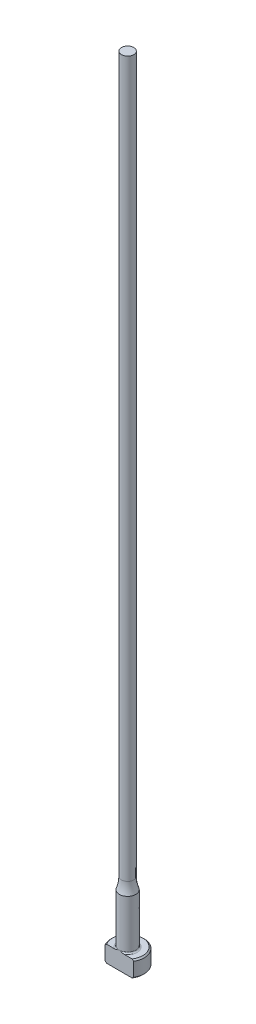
ISO-10303-21;
HEADER;
FILE_DESCRIPTION(('STEP AP214'),'2;1');
FILE_NAME('part.step','',(''),(''),'','','');
FILE_SCHEMA(('AUTOMOTIVE_DESIGN { 1 0 10303 214 1 1 1 1 }'));
ENDSEC;
DATA;
#1=APPLICATION_CONTEXT('core data for automotive mechanical design processes');
#2=APPLICATION_PROTOCOL_DEFINITION('international standard','automotive_design',2000,#1);
#3=PRODUCT_CONTEXT('',#1,'mechanical');
#4=PRODUCT('Part','Part','',(#3));
#5=PRODUCT_RELATED_PRODUCT_CATEGORY('part','',(#4));
#6=PRODUCT_DEFINITION_FORMATION('','',#4);
#7=PRODUCT_DEFINITION_CONTEXT('part definition',#1,'design');
#8=PRODUCT_DEFINITION('design','',#6,#7);
#9=PRODUCT_DEFINITION_SHAPE('','',#8);
#10=(LENGTH_UNIT() NAMED_UNIT(*) SI_UNIT(.MILLI.,.METRE.));
#11=(NAMED_UNIT(*) PLANE_ANGLE_UNIT() SI_UNIT($,.RADIAN.));
#12=(NAMED_UNIT(*) SI_UNIT($,.STERADIAN.) SOLID_ANGLE_UNIT());
#13=UNCERTAINTY_MEASURE_WITH_UNIT(LENGTH_MEASURE(1.E-05),#10,'distance_accuracy_value','');
#14=(GEOMETRIC_REPRESENTATION_CONTEXT(3) GLOBAL_UNCERTAINTY_ASSIGNED_CONTEXT((#13)) GLOBAL_UNIT_ASSIGNED_CONTEXT((#10,
#11,#12)) REPRESENTATION_CONTEXT('',''));
#15=CARTESIAN_POINT('',(0.,0.,0.));
#16=DIRECTION('',(0.,0.,1.));
#17=DIRECTION('',(1.,0.,0.));
#18=AXIS2_PLACEMENT_3D('',#15,#16,#17);
#19=CARTESIAN_POINT('',(-1.18998999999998,152.4,0.));
#20=DIRECTION('',(0.,1.,0.));
#21=DIRECTION('',(0.,0.,1.));
#22=AXIS2_PLACEMENT_3D('',#19,#20,#21);
#23=PLANE('',#22);
#24=CARTESIAN_POINT('',(0.,152.4,0.));
#25=DIRECTION('',(0.,1.,0.));
#26=DIRECTION('',(0.,0.,1.));
#27=AXIS2_PLACEMENT_3D('',#24,#25,#26);
#28=CIRCLE('',#27,1.18998999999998);
#29=CARTESIAN_POINT('',(0.,152.4,1.18998999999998));
#30=VERTEX_POINT('',#29);
#31=EDGE_CURVE('E169',#30,#30,#28,.T.);
#32=ORIENTED_EDGE('',*,*,#31,.T.);
#33=EDGE_LOOP('',(#32));
#34=FACE_BOUND('',#33,.T.);
#35=ADVANCED_FACE('F37',(#34),#23,.T.);
#36=CARTESIAN_POINT('',(0.,259.958771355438,0.));
#37=DIRECTION('',(0.,1.,0.));
#38=DIRECTION('',(0.,0.,1.));
#39=AXIS2_PLACEMENT_3D('',#36,#37,#38);
#40=CYLINDRICAL_SURFACE('',#39,1.18998999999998);
#41=CARTESIAN_POINT('',(0.,14.9114164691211,0.));
#42=DIRECTION('',(0.,1.,0.));
#43=DIRECTION('',(0.,0.,1.));
#44=AXIS2_PLACEMENT_3D('',#41,#42,#43);
#45=CIRCLE('',#44,1.18998999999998);
#46=CARTESIAN_POINT('',(0.,14.9114164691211,1.18998999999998));
#47=VERTEX_POINT('',#46);
#48=EDGE_CURVE('E172',#47,#47,#45,.T.);
#49=ORIENTED_EDGE('',*,*,#48,.T.);
#50=EDGE_LOOP('',(#49));
#51=FACE_BOUND('',#50,.T.);
#52=ORIENTED_EDGE('',*,*,#31,.F.);
#53=EDGE_LOOP('',(#52));
#54=FACE_BOUND('',#53,.T.);
#55=ADVANCED_FACE('F160',(#51,#54),#40,.T.);
#56=CARTESIAN_POINT('',(0.,14.9114164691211,0.));
#57=DIRECTION('',(0.,1.,0.));
#58=DIRECTION('',(0.,0.,1.));
#59=AXIS2_PLACEMENT_3D('',#56,#57,#58);
#60=TOROIDAL_SURFACE('',#59,7.53998999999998,6.35);
#61=CARTESIAN_POINT('',(0.,12.7,0.));
#62=DIRECTION('',(0.,1.,0.));
#63=DIRECTION('',(0.,0.,1.));
#64=AXIS2_PLACEMENT_3D('',#61,#62,#63);
#65=CIRCLE('',#64,1.58749999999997);
#66=CARTESIAN_POINT('',(0.,12.7,1.58749999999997));
#67=VERTEX_POINT('',#66);
#68=EDGE_CURVE('E100',#67,#67,#65,.T.);
#69=ORIENTED_EDGE('',*,*,#68,.T.);
#70=EDGE_LOOP('',(#69));
#71=FACE_BOUND('',#70,.T.);
#72=ORIENTED_EDGE('',*,*,#48,.F.);
#73=EDGE_LOOP('',(#72));
#74=FACE_BOUND('',#73,.T.);
#75=ADVANCED_FACE('F165',(#71,#74),#60,.F.);
#76=CARTESIAN_POINT('',(0.,259.958771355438,0.));
#77=DIRECTION('',(0.,1.,0.));
#78=DIRECTION('',(0.,0.,1.));
#79=AXIS2_PLACEMENT_3D('',#76,#77,#78);
#80=CYLINDRICAL_SURFACE('',#79,1.58749999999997);
#81=CARTESIAN_POINT('',(0.,3.42900000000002,0.));
#82=DIRECTION('',(0.,1.,0.));
#83=DIRECTION('',(0.,0.,1.));
#84=AXIS2_PLACEMENT_3D('',#81,#82,#83);
#85=CIRCLE('',#84,1.58749999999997);
#86=CARTESIAN_POINT('',(0.,3.42900000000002,1.58749999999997));
#87=VERTEX_POINT('',#86);
#88=EDGE_CURVE('E109',#87,#87,#85,.T.);
#89=ORIENTED_EDGE('',*,*,#88,.T.);
#90=EDGE_LOOP('',(#89));
#91=FACE_BOUND('',#90,.T.);
#92=ORIENTED_EDGE('',*,*,#68,.F.);
#93=EDGE_LOOP('',(#92));
#94=FACE_BOUND('',#93,.T.);
#95=ADVANCED_FACE('F192',(#91,#94),#80,.T.);
#96=CARTESIAN_POINT('',(-3.17499999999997,3.175,0.));
#97=DIRECTION('',(0.,1.,0.));
#98=DIRECTION('',(0.,0.,1.));
#99=AXIS2_PLACEMENT_3D('',#96,#97,#98);
#100=PLANE('',#99);
#101=DIRECTION('',(-1.,0.,0.));
#102=VECTOR('',#101,1.);
#103=CARTESIAN_POINT('',(-3.17499999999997,3.175,1.58749999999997));
#104=LINE('',#103,#102);
#105=CARTESIAN_POINT('',(2.45195529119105,3.175,1.58749999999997));
#106=VERTEX_POINT('',#105);
#107=CARTESIAN_POINT('',(0.933255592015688,3.175,1.58749999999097));
#108=VERTEX_POINT('',#107);
#109=EDGE_CURVE('E58',#106,#108,#104,.T.);
#110=ORIENTED_EDGE('',*,*,#109,.F.);
#111=CARTESIAN_POINT('',(0.,3.175,0.));
#112=DIRECTION('',(0.,1.,0.));
#113=DIRECTION('',(0.,0.,1.));
#114=AXIS2_PLACEMENT_3D('',#111,#112,#113);
#115=CIRCLE('',#114,2.92099999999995);
#116=CARTESIAN_POINT('',(-2.45195529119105,3.175,1.58749999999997));
#117=VERTEX_POINT('',#116);
#118=EDGE_CURVE('E171',#106,#117,#115,.T.);
#119=ORIENTED_EDGE('',*,*,#118,.T.);
#120=CARTESIAN_POINT('',(-0.933255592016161,3.17500000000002,1.58749999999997));
#121=VERTEX_POINT('',#120);
#122=EDGE_CURVE('E140',#121,#117,#104,.T.);
#123=ORIENTED_EDGE('',*,*,#122,.F.);
#124=CARTESIAN_POINT('',(0.,3.175,0.));
#125=DIRECTION('',(0.,1.,0.));
#126=DIRECTION('',(0.,0.,1.));
#127=AXIS2_PLACEMENT_3D('',#124,#125,#126);
#128=CIRCLE('',#127,1.84149999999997);
#129=EDGE_CURVE('E113',#121,#108,#128,.F.);
#130=ORIENTED_EDGE('',*,*,#129,.T.);
#131=EDGE_LOOP('',(#110,#119,#123,#130));
#132=FACE_BOUND('',#131,.T.);
#133=ADVANCED_FACE('F189',(#132),#100,.T.);
#134=CARTESIAN_POINT('',(0.,259.958771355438,0.));
#135=DIRECTION('',(0.,1.,0.));
#136=DIRECTION('',(0.,0.,1.));
#137=AXIS2_PLACEMENT_3D('',#134,#135,#136);
#138=CYLINDRICAL_SURFACE('',#137,3.17499999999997);
#139=DIRECTION('',(0.,-1.,0.));
#140=VECTOR('',#139,1.);
#141=CARTESIAN_POINT('',(-2.74963065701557,152.4,1.58749999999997));
#142=LINE('',#141,#140);
#143=CARTESIAN_POINT('',(-2.74963065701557,2.921,1.58749999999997));
#144=VERTEX_POINT('',#143);
#145=CARTESIAN_POINT('',(-2.74963065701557,0.254000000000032,1.58749999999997));
#146=VERTEX_POINT('',#145);
#147=EDGE_CURVE('E95',#144,#146,#142,.T.);
#148=ORIENTED_EDGE('',*,*,#147,.F.);
#149=CARTESIAN_POINT('',(0.,2.92100000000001,0.));
#150=DIRECTION('',(0.,1.,0.));
#151=DIRECTION('',(0.,0.,1.));
#152=AXIS2_PLACEMENT_3D('',#149,#150,#151);
#153=CIRCLE('',#152,3.17499999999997);
#154=CARTESIAN_POINT('',(2.74963065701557,2.921,1.58749999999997));
#155=VERTEX_POINT('',#154);
#156=EDGE_CURVE('E110',#144,#155,#153,.F.);
#157=ORIENTED_EDGE('',*,*,#156,.T.);
#158=DIRECTION('',(0.,-1.,0.));
#159=VECTOR('',#158,1.);
#160=CARTESIAN_POINT('',(2.74963065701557,152.4,1.58749999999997));
#161=LINE('',#160,#159);
#162=CARTESIAN_POINT('',(2.74963065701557,0.254000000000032,1.58749999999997));
#163=VERTEX_POINT('',#162);
#164=EDGE_CURVE('E182',#155,#163,#161,.T.);
#165=ORIENTED_EDGE('',*,*,#164,.T.);
#166=CARTESIAN_POINT('',(0.,0.254000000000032,0.));
#167=DIRECTION('',(0.,-1.,0.));
#168=DIRECTION('',(0.,0.,-1.));
#169=AXIS2_PLACEMENT_3D('',#166,#167,#168);
#170=CIRCLE('',#169,3.17499999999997);
#171=EDGE_CURVE('E116',#163,#146,#170,.F.);
#172=ORIENTED_EDGE('',*,*,#171,.T.);
#173=EDGE_LOOP('',(#148,#157,#165,#172));
#174=FACE_BOUND('',#173,.T.);
#175=ADVANCED_FACE('F180',(#174),#138,.T.);
#176=CARTESIAN_POINT('',(0.,0.,0.));
#177=DIRECTION('',(0.,-1.,0.));
#178=DIRECTION('',(0.,0.,-1.));
#179=AXIS2_PLACEMENT_3D('',#176,#177,#178);
#180=PLANE('',#179);
#181=DIRECTION('',(1.,0.,0.));
#182=VECTOR('',#181,1.);
#183=CARTESIAN_POINT('',(-2.74963065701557,0.,1.58749999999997));
#184=LINE('',#183,#182);
#185=CARTESIAN_POINT('',(-2.45195529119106,0.,1.58749999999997));
#186=VERTEX_POINT('',#185);
#187=CARTESIAN_POINT('',(2.45195529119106,0.,1.58749999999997));
#188=VERTEX_POINT('',#187);
#189=EDGE_CURVE('E92',#186,#188,#184,.T.);
#190=ORIENTED_EDGE('',*,*,#189,.F.);
#191=CARTESIAN_POINT('',(0.,0.,0.));
#192=DIRECTION('',(0.,-1.,0.));
#193=DIRECTION('',(0.,0.,-1.));
#194=AXIS2_PLACEMENT_3D('',#191,#192,#193);
#195=CIRCLE('',#194,2.92099999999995);
#196=EDGE_CURVE('E106',#186,#188,#195,.T.);
#197=ORIENTED_EDGE('',*,*,#196,.T.);
#198=EDGE_LOOP('',(#190,#197));
#199=FACE_BOUND('',#198,.T.);
#200=ADVANCED_FACE('F105',(#199),#180,.T.);
#201=CARTESIAN_POINT('',(0.,3.17499999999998,0.));
#202=DIRECTION('',(0.,-1.,0.));
#203=DIRECTION('',(0.,0.,-1.));
#204=AXIS2_PLACEMENT_3D('',#201,#202,#203);
#205=CONICAL_SURFACE('',#204,2.92099999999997,0.7853981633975);
#206=CARTESIAN_POINT('',(2.75033065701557,2.9203937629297,1.58749999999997));
#207=CARTESIAN_POINT('',(2.66887796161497,2.99091042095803,1.58749999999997));
#208=CARTESIAN_POINT('',(2.58705989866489,3.0610138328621,1.58749999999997));
#209=CARTESIAN_POINT('',(2.42241022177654,3.20009957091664,1.58749999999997));
#210=CARTESIAN_POINT('',(2.33957813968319,3.26908134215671,1.58749999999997));
#211=CARTESIAN_POINT('',(2.17073968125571,3.40716024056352,1.58749999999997));
#212=CARTESIAN_POINT('',(2.08470440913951,3.47622217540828,1.58749999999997));
#213=CARTESIAN_POINT('',(1.91099881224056,3.61222325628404,1.58749999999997));
#214=CARTESIAN_POINT('',(1.82332890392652,3.67916293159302,1.58749999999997));
#215=CARTESIAN_POINT('',(1.64569223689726,3.81020667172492,1.58749999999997));
#216=CARTESIAN_POINT('',(1.55572245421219,3.87430666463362,1.58749999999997));
#217=CARTESIAN_POINT('',(1.37280394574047,3.99833089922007,1.58749999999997));
#218=CARTESIAN_POINT('',(1.27985285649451,4.05825170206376,1.58749999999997));
#219=CARTESIAN_POINT('',(1.09086561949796,4.17130826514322,1.58749999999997));
#220=CARTESIAN_POINT('',(0.99485990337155,4.22449421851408,1.58749999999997));
#221=CARTESIAN_POINT('',(0.798114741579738,4.32122233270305,1.58749999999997));
#222=CARTESIAN_POINT('',(0.697384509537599,4.36478238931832,1.58749999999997));
#223=CARTESIAN_POINT('',(0.541185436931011,4.4195165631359,1.58749999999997));
#224=CARTESIAN_POINT('',(0.487627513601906,4.43611950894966,1.58749999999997));
#225=CARTESIAN_POINT('',(0.379267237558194,4.46466012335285,1.58749999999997));
#226=CARTESIAN_POINT('',(0.324465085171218,4.47659853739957,1.58749999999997));
#227=CARTESIAN_POINT('',(0.214272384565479,4.49501904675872,1.58749999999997));
#228=CARTESIAN_POINT('',(0.158887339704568,4.50153345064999,1.58749999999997));
#229=CARTESIAN_POINT('',(0.0477364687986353,4.50875028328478,1.58749999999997));
#230=CARTESIAN_POINT('',(-0.00802931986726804,4.50945327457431,1.58749999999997));
#231=CARTESIAN_POINT('',(-0.119372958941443,4.50499163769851,1.58749999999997));
#232=CARTESIAN_POINT('',(-0.174950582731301,4.49982147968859,1.58749999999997));
#233=CARTESIAN_POINT('',(-0.285312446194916,4.48399101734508,1.58749999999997));
#234=CARTESIAN_POINT('',(-0.340096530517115,4.47332965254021,1.58749999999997));
#235=CARTESIAN_POINT('',(-0.448865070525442,4.44711334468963,1.58749999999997));
#236=CARTESIAN_POINT('',(-0.50284128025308,4.43152477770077,1.58749999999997));
#237=CARTESIAN_POINT('',(-0.609429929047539,4.39628553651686,1.58749999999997));
#238=CARTESIAN_POINT('',(-0.66204236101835,4.3766348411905,1.58749999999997));
#239=CARTESIAN_POINT('',(-0.778129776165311,4.32902110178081,1.58749999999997));
#240=CARTESIAN_POINT('',(-0.84124591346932,4.30019026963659,1.58749999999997));
#241=CARTESIAN_POINT('',(-0.965594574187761,4.23868811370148,1.58749999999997));
#242=CARTESIAN_POINT('',(-1.02682597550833,4.20601455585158,1.58749999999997));
#243=CARTESIAN_POINT('',(-1.14774341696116,4.13769010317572,1.58749999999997));
#244=CARTESIAN_POINT('',(-1.20742632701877,4.10203371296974,1.58749999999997));
#245=CARTESIAN_POINT('',(-1.32539130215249,4.02846531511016,1.58749999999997));
#246=CARTESIAN_POINT('',(-1.38367308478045,3.9905528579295,1.58749999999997));
#247=CARTESIAN_POINT('',(-1.55734442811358,3.87382704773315,1.58749999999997));
#248=CARTESIAN_POINT('',(-1.67095842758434,3.79237897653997,1.58749999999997));
#249=CARTESIAN_POINT('',(-1.8947523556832,3.6252186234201,1.58749999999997));
#250=CARTESIAN_POINT('',(-2.00493591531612,3.53951111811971,1.58749999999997));
#251=CARTESIAN_POINT('',(-2.22248693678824,3.3655494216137,1.58749999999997));
#252=CARTESIAN_POINT('',(-2.32986450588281,3.27730782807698,1.58749999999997));
#253=CARTESIAN_POINT('',(-2.48909538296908,3.14389342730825,1.58749999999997));
#254=CARTESIAN_POINT('',(-2.54159338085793,3.09948435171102,1.58749999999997));
#255=CARTESIAN_POINT('',(-2.64622282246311,3.01024124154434,1.58749999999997));
#256=CARTESIAN_POINT('',(-2.69835428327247,2.96540722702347,1.58749999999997));
#257=CARTESIAN_POINT('',(-2.75033065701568,2.92039376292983,1.58749999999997));
#258=B_SPLINE_CURVE_WITH_KNOTS('',3,(#206,#207,#208,#209,#210,#211,#212,#213,#214,#215,#216,
#217,#218,#219,#220,#221,#222,#223,#224,#225,#226,#227,#228,#229,#230,#231,#232,#233,#234,#235,
#236,#237,#238,#239,#240,#241,#242,#243,#244,#245,#246,#247,#248,#249,#250,#251,#252,#253,#254,
#255,#256,#257),.UNSPECIFIED.,.F.,.F.,(4,2,2,2,2,2,2,2,2,2,2,2,2,2,2,2,2,2,2,2,2,2,2,2,2,4),(0.,
0.323216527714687,0.64658837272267,0.977539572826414,1.30840757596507,1.63973560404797,
1.97133312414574,2.30029221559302,2.62863448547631,2.79668277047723,2.9647041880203,
3.13171746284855,3.29871457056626,3.46586904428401,3.63305581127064,3.80140905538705,
3.96976317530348,4.17775353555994,4.38586541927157,4.59436953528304,4.80291533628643,
5.22209642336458,5.64081759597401,6.0577303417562,6.26401477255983,6.47028951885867),.UNSPECIFIED.);
#259=EDGE_CURVE('E63',#155,#106,#258,.T.);
#260=ORIENTED_EDGE('',*,*,#259,.F.);
#261=ORIENTED_EDGE('',*,*,#156,.F.);
#262=EDGE_CURVE('E133',#117,#144,#258,.T.);
#263=ORIENTED_EDGE('',*,*,#262,.F.);
#264=ORIENTED_EDGE('',*,*,#118,.F.);
#265=EDGE_LOOP('',(#260,#261,#263,#264));
#266=FACE_BOUND('',#265,.T.);
#267=ADVANCED_FACE('F147',(#266),#205,.T.);
#268=CARTESIAN_POINT('',(0.,0.254000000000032,0.));
#269=DIRECTION('',(0.,1.,0.));
#270=DIRECTION('',(0.,0.,1.));
#271=AXIS2_PLACEMENT_3D('',#268,#269,#270);
#272=CONICAL_SURFACE('',#271,3.17499999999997,0.785398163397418);
#273=CARTESIAN_POINT('',(-2.75033065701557,0.254606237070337,1.58749999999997));
#274=CARTESIAN_POINT('',(-2.66887796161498,0.184089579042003,1.58749999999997));
#275=CARTESIAN_POINT('',(-2.58705989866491,0.113986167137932,1.58749999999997));
#276=CARTESIAN_POINT('',(-2.42241022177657,-0.0250995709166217,1.58749999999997));
#277=CARTESIAN_POINT('',(-2.33957813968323,-0.0940813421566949,1.58749999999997));
#278=CARTESIAN_POINT('',(-2.17073968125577,-0.232160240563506,1.58749999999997));
#279=CARTESIAN_POINT('',(-2.08470440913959,-0.301222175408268,1.58749999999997));
#280=CARTESIAN_POINT('',(-1.91099881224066,-0.437223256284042,1.58749999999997));
#281=CARTESIAN_POINT('',(-1.82332890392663,-0.504162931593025,1.58749999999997));
#282=CARTESIAN_POINT('',(-1.64569223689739,-0.635206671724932,1.58749999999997));
#283=CARTESIAN_POINT('',(-1.55572245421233,-0.699306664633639,1.58749999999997));
#284=CARTESIAN_POINT('',(-1.37280394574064,-0.8233308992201,1.58749999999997));
#285=CARTESIAN_POINT('',(-1.27985285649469,-0.883251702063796,1.58749999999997));
#286=CARTESIAN_POINT('',(-1.09086561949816,-0.996308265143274,1.58749999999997));
#287=CARTESIAN_POINT('',(-0.994859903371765,-1.04949421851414,1.58749999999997));
#288=CARTESIAN_POINT('',(-0.798114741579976,-1.14622233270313,1.58749999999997));
#289=CARTESIAN_POINT('',(-0.697384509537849,-1.18978238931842,1.58749999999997));
#290=CARTESIAN_POINT('',(-0.54118543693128,-1.24451656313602,1.58749999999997));
#291=CARTESIAN_POINT('',(-0.487627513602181,-1.26111950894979,1.58749999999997));
#292=CARTESIAN_POINT('',(-0.379267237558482,-1.28966012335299,1.58749999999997));
#293=CARTESIAN_POINT('',(-0.324465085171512,-1.30159853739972,1.58749999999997));
#294=CARTESIAN_POINT('',(-0.214272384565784,-1.3200190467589,1.58749999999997));
#295=CARTESIAN_POINT('',(-0.158887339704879,-1.32653345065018,1.58749999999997));
#296=CARTESIAN_POINT('',(-0.0477364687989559,-1.33375028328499,1.58749999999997));
#297=CARTESIAN_POINT('',(0.00802931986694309,-1.33445327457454,1.58749999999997));
#298=CARTESIAN_POINT('',(0.119372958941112,-1.32999163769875,1.58749999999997));
#299=CARTESIAN_POINT('',(0.174950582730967,-1.32482147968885,1.58749999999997));
#300=CARTESIAN_POINT('',(0.28531244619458,-1.30899101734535,1.58749999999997));
#301=CARTESIAN_POINT('',(0.340096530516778,-1.2983296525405,1.58749999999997));
#302=CARTESIAN_POINT('',(0.448865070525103,-1.27211334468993,1.58749999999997));
#303=CARTESIAN_POINT('',(0.50284128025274,-1.25652477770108,1.58749999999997));
#304=CARTESIAN_POINT('',(0.609429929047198,-1.22128553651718,1.58749999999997));
#305=CARTESIAN_POINT('',(0.662042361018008,-1.20163484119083,1.58749999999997));
#306=CARTESIAN_POINT('',(0.778129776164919,-1.15402110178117,1.58749999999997));
#307=CARTESIAN_POINT('',(0.84124591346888,-1.12519026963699,1.58749999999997));
#308=CARTESIAN_POINT('',(0.965594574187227,-1.06368811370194,1.58749999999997));
#309=CARTESIAN_POINT('',(1.02682597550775,-1.03101455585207,1.58749999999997));
#310=CARTESIAN_POINT('',(1.14774341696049,-0.962690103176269,1.58749999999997));
#311=CARTESIAN_POINT('',(1.20742632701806,-0.927033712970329,1.58749999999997));
#312=CARTESIAN_POINT('',(1.32539130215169,-0.853465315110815,1.58749999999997));
#313=CARTESIAN_POINT('',(1.38367308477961,-0.815552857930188,1.58749999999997));
#314=CARTESIAN_POINT('',(1.5573444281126,-0.698827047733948,1.58749999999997));
#315=CARTESIAN_POINT('',(1.67095842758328,-0.617378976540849,1.58749999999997));
#316=CARTESIAN_POINT('',(1.89475235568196,-0.450218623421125,1.58749999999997));
#317=CARTESIAN_POINT('',(2.0049359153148,-0.364511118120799,1.58749999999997));
#318=CARTESIAN_POINT('',(2.22248693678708,-0.190549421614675,1.58749999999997));
#319=CARTESIAN_POINT('',(2.32986450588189,-0.102307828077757,1.58749999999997));
#320=CARTESIAN_POINT('',(2.48909538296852,0.0311065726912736,1.58749999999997));
#321=CARTESIAN_POINT('',(2.54159338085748,0.0755156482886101,1.58749999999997));
#322=CARTESIAN_POINT('',(2.64622282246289,0.164758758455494,1.58749999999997));
#323=CARTESIAN_POINT('',(2.69835428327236,0.20959277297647,1.58749999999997));
#324=CARTESIAN_POINT('',(2.75033065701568,0.25460623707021,1.58749999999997));
#325=B_SPLINE_CURVE_WITH_KNOTS('',3,(#273,#274,#275,#276,#277,#278,#279,#280,#281,#282,#283,
#284,#285,#286,#287,#288,#289,#290,#291,#292,#293,#294,#295,#296,#297,#298,#299,#300,#301,#302,
#303,#304,#305,#306,#307,#308,#309,#310,#311,#312,#313,#314,#315,#316,#317,#318,#319,#320,#321,
#322,#323,#324),.UNSPECIFIED.,.F.,.F.,(4,2,2,2,2,2,2,2,2,2,2,2,2,2,2,2,2,2,2,2,2,2,2,2,2,4),(0.,
0.323216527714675,0.646588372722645,0.977539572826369,1.308407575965,1.63973560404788,
1.97133312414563,2.3002922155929,2.62863448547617,2.79668277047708,2.96470418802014,
3.13171746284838,3.29871457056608,3.46586904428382,3.63305581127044,3.80140905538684,
3.96976317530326,4.17775353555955,4.38586541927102,4.59436953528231,4.80291533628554,
5.22209642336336,5.64081759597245,6.05773034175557,6.26401477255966,6.47028951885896),.UNSPECIFIED.);
#326=EDGE_CURVE('E89',#146,#186,#325,.T.);
#327=ORIENTED_EDGE('',*,*,#326,.F.);
#328=ORIENTED_EDGE('',*,*,#171,.F.);
#329=EDGE_CURVE('E101',#188,#163,#325,.T.);
#330=ORIENTED_EDGE('',*,*,#329,.F.);
#331=ORIENTED_EDGE('',*,*,#196,.F.);
#332=EDGE_LOOP('',(#327,#328,#330,#331));
#333=FACE_BOUND('',#332,.T.);
#334=ADVANCED_FACE('F108',(#333),#272,.T.);
#335=CARTESIAN_POINT('',(0.,3.42900000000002,0.));
#336=DIRECTION('',(0.,1.,0.));
#337=DIRECTION('',(0.,0.,1.));
#338=AXIS2_PLACEMENT_3D('',#335,#336,#337);
#339=TOROIDAL_SURFACE('',#338,1.84149999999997,0.254);
#340=ORIENTED_EDGE('',*,*,#129,.F.);
#341=CARTESIAN_POINT('',(0.,3.42900000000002,1.58749999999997));
#342=CARTESIAN_POINT('',(-1.9220500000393E-10,3.42900057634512,1.58749999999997));
#343=CARTESIAN_POINT('',(-1.22611614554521E-07,3.42900115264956,1.58749999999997));
#344=CARTESIAN_POINT('',(-5.09676364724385E-07,3.42900226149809,1.58749999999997));
#345=CARTESIAN_POINT('',(-7.78176327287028E-07,3.42900279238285,1.58749999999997));
#346=CARTESIAN_POINT('',(-1.42307272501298E-06,3.42900385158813,1.58749999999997));
#347=CARTESIAN_POINT('',(-1.80713867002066E-06,3.42900437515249,1.58749999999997));
#348=CARTESIAN_POINT('',(-2.63494846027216E-06,3.42900536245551,1.58749999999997));
#349=CARTESIAN_POINT('',(-3.07814756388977E-06,3.42900582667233,1.58749999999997));
#350=CARTESIAN_POINT('',(-4.66897357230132E-06,3.42900738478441,1.58749999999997));
#351=CARTESIAN_POINT('',(-5.89404907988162E-06,3.42900840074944,1.58749999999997));
#352=CARTESIAN_POINT('',(-8.42427510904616E-06,3.42901020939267,1.58749999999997));
#353=CARTESIAN_POINT('',(-9.72480574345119E-06,3.42901100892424,1.58749999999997));
#354=CARTESIAN_POINT('',(-1.48060601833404E-05,3.42901401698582,1.58749999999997));
#355=CARTESIAN_POINT('',(-1.86838281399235E-05,3.42901606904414,1.58749999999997));
#356=CARTESIAN_POINT('',(-2.63261117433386E-05,3.42901942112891,1.58749999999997));
#357=CARTESIAN_POINT('',(-3.0068741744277E-05,3.42902077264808,1.58749999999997));
#358=CARTESIAN_POINT('',(-4.60276298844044E-05,3.42902652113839,1.58749999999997));
#359=CARTESIAN_POINT('',(-5.82470198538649E-05,3.42903088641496,1.58749999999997));
#360=CARTESIAN_POINT('',(-8.11070097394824E-05,3.42903788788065,1.58749999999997));
#361=CARTESIAN_POINT('',(-9.16953114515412E-05,3.42904068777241,1.58749999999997));
#362=CARTESIAN_POINT('',(-0.000168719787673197,3.42906287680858,1.58749999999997));
#363=CARTESIAN_POINT('',(-0.000232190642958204,3.4290911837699,1.58749999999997));
#364=CARTESIAN_POINT('',(-0.000479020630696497,3.42919723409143,1.58749999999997));
#365=CARTESIAN_POINT('',(-0.000664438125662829,3.42926834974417,1.58749999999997));
#366=CARTESIAN_POINT('',(-0.0013844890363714,3.42954862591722,1.58749999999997));
#367=CARTESIAN_POINT('',(-0.00191701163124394,3.42976473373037,1.58749999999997));
#368=CARTESIAN_POINT('',(-0.00409774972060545,3.4306455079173,1.58749999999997));
#369=CARTESIAN_POINT('',(-0.00574830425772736,3.43130231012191,1.58749999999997));
#370=CARTESIAN_POINT('',(-0.0289985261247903,3.4405594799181,1.58749999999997));
#371=CARTESIAN_POINT('',(-0.0505816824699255,3.4492167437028,1.58749999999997));
#372=CARTESIAN_POINT('',(-0.0929947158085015,3.46610702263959,1.58749999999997));
#373=CARTESIAN_POINT('',(-0.113823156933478,3.47434394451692,1.58749999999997));
#374=CARTESIAN_POINT('',(-0.157956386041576,3.49164606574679,1.58749999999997));
#375=CARTESIAN_POINT('',(-0.181267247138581,3.50069608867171,1.58749999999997));
#376=CARTESIAN_POINT('',(-0.228222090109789,3.51863224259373,1.58749999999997));
#377=CARTESIAN_POINT('',(-0.25186705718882,3.52751579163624,1.58749999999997));
#378=CARTESIAN_POINT('',(-0.310512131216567,3.54905503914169,1.58749999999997));
#379=CARTESIAN_POINT('',(-0.345588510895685,3.56150550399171,1.58749999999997));
#380=CARTESIAN_POINT('',(-0.415278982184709,3.5850302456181,1.58749999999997));
#381=CARTESIAN_POINT('',(-0.449884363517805,3.59613012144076,1.58749999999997));
#382=CARTESIAN_POINT('',(-0.524471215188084,3.61841679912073,1.58749999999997));
#383=CARTESIAN_POINT('',(-0.564517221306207,3.62939137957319,1.58749999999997));
#384=CARTESIAN_POINT('',(-0.645529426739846,3.6489746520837,1.58749999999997));
#385=CARTESIAN_POINT('',(-0.686500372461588,3.65756417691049,1.58749999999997));
#386=CARTESIAN_POINT('',(-0.771546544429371,3.67188287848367,1.58749999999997));
#387=CARTESIAN_POINT('',(-0.815658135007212,3.67740449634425,1.58749999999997));
#388=CARTESIAN_POINT('',(-0.904117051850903,3.68344603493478,1.58749999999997));
#389=CARTESIAN_POINT('',(-0.948462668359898,3.68398638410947,1.58749999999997));
#390=CARTESIAN_POINT('',(-1.02531896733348,3.67901051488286,1.58749999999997));
#391=CARTESIAN_POINT('',(-1.05792141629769,3.67502604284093,1.58749999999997));
#392=CARTESIAN_POINT('',(-1.12184393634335,3.66230832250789,1.58749999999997));
#393=CARTESIAN_POINT('',(-1.1531753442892,3.65363950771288,1.58749999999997));
#394=CARTESIAN_POINT('',(-1.19946468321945,3.6356384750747,1.58749999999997));
#395=CARTESIAN_POINT('',(-1.21526783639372,3.62848492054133,1.58749999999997));
#396=CARTESIAN_POINT('',(-1.24583726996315,3.61212937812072,1.58749999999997));
#397=CARTESIAN_POINT('',(-1.26060215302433,3.60292469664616,1.58749999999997));
#398=CARTESIAN_POINT('',(-1.28575815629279,3.58421518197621,1.58749999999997));
#399=CARTESIAN_POINT('',(-1.29644383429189,3.57510998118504,1.58749999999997));
#400=CARTESIAN_POINT('',(-1.31623154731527,3.55531539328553,1.58749999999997));
#401=CARTESIAN_POINT('',(-1.32533681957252,3.54462932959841,1.58749999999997));
#402=CARTESIAN_POINT('',(-1.33941140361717,3.52450022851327,1.58749999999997));
#403=CARTESIAN_POINT('',(-1.34484814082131,3.51538553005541,1.58749999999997));
#404=CARTESIAN_POINT('',(-1.35416329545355,3.49638544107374,1.58749999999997));
#405=CARTESIAN_POINT('',(-1.35804267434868,3.48650053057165,1.58749999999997));
#406=CARTESIAN_POINT('',(-1.36398436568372,3.46611321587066,1.58749999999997));
#407=CARTESIAN_POINT('',(-1.36603350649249,3.45560690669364,1.58749999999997));
#408=CARTESIAN_POINT('',(-1.3680840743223,3.43439627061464,1.58749999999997));
#409=CARTESIAN_POINT('',(-1.36808648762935,3.42369204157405,1.58749999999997));
#410=CARTESIAN_POINT('',(-1.36616208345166,3.40366716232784,1.58749999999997));
#411=CARTESIAN_POINT('',(-1.36444960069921,3.39432493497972,1.58749999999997));
#412=CARTESIAN_POINT('',(-1.35953338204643,3.37604480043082,1.58749999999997));
#413=CARTESIAN_POINT('',(-1.3563294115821,3.36710695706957,1.58749999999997));
#414=CARTESIAN_POINT('',(-1.34848006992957,3.34949697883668,1.58749999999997));
#415=CARTESIAN_POINT('',(-1.34378578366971,3.34084688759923,1.58749999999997));
#416=CARTESIAN_POINT('',(-1.33324445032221,3.32428742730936,1.58749999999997));
#417=CARTESIAN_POINT('',(-1.32739692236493,3.31637836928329,1.58749999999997));
#418=CARTESIAN_POINT('',(-1.31107304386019,3.29692878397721,1.58749999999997));
#419=CARTESIAN_POINT('',(-1.29989286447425,3.28597778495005,1.58749999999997));
#420=CARTESIAN_POINT('',(-1.27593566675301,3.26597490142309,1.58749999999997));
#421=CARTESIAN_POINT('',(-1.2631537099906,3.25692913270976,1.58749999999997));
#422=CARTESIAN_POINT('',(-1.22930733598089,3.23613976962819,1.58749999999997));
#423=CARTESIAN_POINT('',(-1.20751096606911,3.22559415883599,1.58749999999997));
#424=CARTESIAN_POINT('',(-1.16266144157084,3.20795356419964,1.58749999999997));
#425=CARTESIAN_POINT('',(-1.13960937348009,3.20085564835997,1.58749999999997));
#426=CARTESIAN_POINT('',(-1.07603916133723,3.18534571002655,1.58749999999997));
#427=CARTESIAN_POINT('',(-1.03486686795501,3.17965078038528,1.58749999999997));
#428=CARTESIAN_POINT('',(-0.951558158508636,3.1741711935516,1.58749999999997));
#429=CARTESIAN_POINT('',(-0.909417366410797,3.17449023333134,1.58749999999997));
#430=CARTESIAN_POINT('',(-0.811383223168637,3.18054602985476,1.58749999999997));
#431=CARTESIAN_POINT('',(-0.755610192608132,3.18806126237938,1.58749999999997));
#432=CARTESIAN_POINT('',(-0.644937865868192,3.20866626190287,1.58749999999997));
#433=CARTESIAN_POINT('',(-0.590043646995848,3.2217810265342,1.58749999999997));
#434=CARTESIAN_POINT('',(-0.485757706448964,3.25059077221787,1.58749999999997));
#435=CARTESIAN_POINT('',(-0.436281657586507,3.2659890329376,1.58749999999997));
#436=CARTESIAN_POINT('',(-0.338551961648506,3.29877502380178,1.58749999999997));
#437=CARTESIAN_POINT('',(-0.290291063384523,3.31614156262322,1.58749999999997));
#438=CARTESIAN_POINT('',(-0.225557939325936,3.34039762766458,1.58749999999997));
#439=CARTESIAN_POINT('',(-0.208874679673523,3.34673586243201,1.58749999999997));
#440=CARTESIAN_POINT('',(-0.175123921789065,3.35969957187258,1.58749999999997));
#441=CARTESIAN_POINT('',(-0.158057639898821,3.36632823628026,1.58749999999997));
#442=CARTESIAN_POINT('',(-0.117638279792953,3.38214476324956,1.58749999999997));
#443=CARTESIAN_POINT('',(-0.0943002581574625,3.39137029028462,1.58749999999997));
#444=CARTESIAN_POINT('',(-0.049782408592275,3.40910304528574,1.58749999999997));
#445=CARTESIAN_POINT('',(-0.028598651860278,3.41759960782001,1.58749999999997));
#446=CARTESIAN_POINT('',(-0.00575168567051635,3.42669635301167,1.58749999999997));
#447=CARTESIAN_POINT('',(-0.00410451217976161,3.42735181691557,1.58749999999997));
#448=CARTESIAN_POINT('',(-0.00192459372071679,3.42823223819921,1.58749999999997));
#449=CARTESIAN_POINT('',(-0.00138952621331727,3.42844937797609,1.58749999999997));
#450=CARTESIAN_POINT('',(-0.000666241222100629,3.42873091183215,1.58749999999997));
#451=CARTESIAN_POINT('',(-0.000480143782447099,3.42880228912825,1.58749999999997));
#452=CARTESIAN_POINT('',(-0.000232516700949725,3.4289086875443,1.58749999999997));
#453=CARTESIAN_POINT('',(-0.00016892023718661,3.42893705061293,1.58749999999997));
#454=CARTESIAN_POINT('',(-9.17527161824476E-05,3.42895927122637,1.58749999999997));
#455=CARTESIAN_POINT('',(-8.11550293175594E-05,3.42896207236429,1.58749999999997));
#456=CARTESIAN_POINT('',(-5.82743948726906E-05,3.4289690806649,1.58749999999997));
#457=CARTESIAN_POINT('',(-4.60440001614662E-05,3.4289734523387,1.58749999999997));
#458=CARTESIAN_POINT('',(-3.00727682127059E-05,3.42897920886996,1.58749999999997));
#459=CARTESIAN_POINT('',(-2.63286807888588E-05,3.42898056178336,1.58749999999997));
#460=CARTESIAN_POINT('',(-1.86836529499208E-05,3.42898391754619,1.58749999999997));
#461=CARTESIAN_POINT('',(-1.48046517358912E-05,3.42898597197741,1.58749999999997));
#462=CARTESIAN_POINT('',(-9.72223943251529E-06,3.42898898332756,1.58749999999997));
#463=CARTESIAN_POINT('',(-8.4215964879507E-06,3.4289897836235,1.58749999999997));
#464=CARTESIAN_POINT('',(-5.89129728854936E-06,3.428991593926,1.58749999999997));
#465=CARTESIAN_POINT('',(-4.66626866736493E-06,3.42899261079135,1.58749999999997));
#466=CARTESIAN_POINT('',(-3.07568803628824E-06,3.42899417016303,1.58749999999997));
#467=CARTESIAN_POINT('',(-2.63259565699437E-06,3.42899463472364,1.58749999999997));
#468=CARTESIAN_POINT('',(-1.80506085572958E-06,3.42899562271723,1.58749999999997));
#469=CARTESIAN_POINT('',(-1.42116387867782E-06,3.4289961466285,1.58749999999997));
#470=CARTESIAN_POINT('',(-7.76675642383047E-07,3.42899720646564,1.58749999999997));
#471=CARTESIAN_POINT('',(-5.08406487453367E-07,3.42899773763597,1.58749999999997));
#472=CARTESIAN_POINT('',(-1.21901887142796E-07,3.42899884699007,1.58749999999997));
#473=CARTESIAN_POINT('',(1.92251529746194E-10,3.42899942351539,1.58749999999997));
#474=CARTESIAN_POINT('',(0.,3.42900000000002,1.58749999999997));
#475=B_SPLINE_CURVE_WITH_KNOTS('',3,(#341,#342,#343,#344,#345,#346,#347,#348,#349,#350,#351,
#352,#353,#354,#355,#356,#357,#358,#359,#360,#361,#362,#363,#364,#365,#366,#367,#368,#369,#370,
#371,#372,#373,#374,#375,#376,#377,#378,#379,#380,#381,#382,#383,#384,#385,#386,#387,#388,#389,
#390,#391,#392,#393,#394,#395,#396,#397,#398,#399,#400,#401,#402,#403,#404,#405,#406,#407,#408,
#409,#410,#411,#412,#413,#414,#415,#416,#417,#418,#419,#420,#421,#422,#423,#424,#425,#426,#427,
#428,#429,#430,#431,#432,#433,#434,#435,#436,#437,#438,#439,#440,#441,#442,#443,#444,#445,#446,
#447,#448,#449,#450,#451,#452,#453,#454,#455,#456,#457,#458,#459,#460,#461,#462,#463,#464,#465,
#466,#467,#468,#469,#470,#471,#472,#473,#474),.UNSPECIFIED.,.T.,.F.,(4,2,2,2,2,2,2,2,2,2,2,2,2,
2,2,2,2,2,2,2,2,2,2,2,2,2,2,2,2,2,2,2,2,2,2,2,2,2,2,2,2,2,2,2,2,2,2,2,2,2,2,2,2,2,2,2,2,2,2,2,2,
2,2,2,2,2,4),(0.,1.72815459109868E-06,3.50429256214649E-06,5.44431005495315E-06,
7.36755250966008E-06,1.21190896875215E-05,1.66953775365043E-05,2.98160400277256E-05,
4.17409564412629E-05,8.06604753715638E-05,0.000113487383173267,0.000321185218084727,
0.000917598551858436,0.00264089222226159,0.00797105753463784,0.0777276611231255,
0.144923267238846,0.219939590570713,0.295714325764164,0.407362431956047,0.516367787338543,
0.640878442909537,0.766362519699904,0.899536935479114,1.03216495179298,1.130457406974,
1.22743103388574,1.27935899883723,1.33135556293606,1.3733324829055,1.41522237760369,
1.44693946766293,1.47863694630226,1.51056074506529,1.54246916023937,1.57083210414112,
1.59919951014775,1.62861579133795,1.65804436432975,1.70472658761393,1.75155645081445,
1.82378709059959,1.89595619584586,2.01995471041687,2.14609321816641,2.31447224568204,
2.4836109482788,2.63898919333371,2.79283011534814,2.8463703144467,2.90129461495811,
2.9765823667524,3.04504771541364,3.05036697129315,3.0520984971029,3.0526970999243,
3.05290520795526,3.05293806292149,3.05297701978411,3.05298895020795,3.05300207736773,
3.05300665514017,3.05301140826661,3.0530133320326,3.05301527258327,3.05301704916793,
3.05301877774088),.UNSPECIFIED.);
#476=EDGE_CURVE('E11',#121,#87,#475,.T.);
#477=ORIENTED_EDGE('',*,*,#476,.T.);
#478=ORIENTED_EDGE('',*,*,#88,.F.);
#479=CARTESIAN_POINT('',(0.,3.42900000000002,1.58749999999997));
#480=CARTESIAN_POINT('',(1.92205030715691E-10,3.42899942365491,1.58749999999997));
#481=CARTESIAN_POINT('',(1.22611614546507E-07,3.42899884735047,1.58749999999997));
#482=CARTESIAN_POINT('',(5.09676364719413E-07,3.42899773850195,1.58749999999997));
#483=CARTESIAN_POINT('',(7.78176327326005E-07,3.42899720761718,1.58749999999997));
#484=CARTESIAN_POINT('',(1.42307272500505E-06,3.4289961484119,1.58749999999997));
#485=CARTESIAN_POINT('',(1.80713866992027E-06,3.42899562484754,1.58749999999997));
#486=CARTESIAN_POINT('',(2.63494846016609E-06,3.42899463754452,1.58749999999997));
#487=CARTESIAN_POINT('',(3.07814756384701E-06,3.4289941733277,1.58749999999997));
#488=CARTESIAN_POINT('',(4.66897357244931E-06,3.42899261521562,1.58749999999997));
#489=CARTESIAN_POINT('',(5.89404907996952E-06,3.42899159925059,1.58749999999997));
#490=CARTESIAN_POINT('',(8.42427510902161E-06,3.42898979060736,1.58749999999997));
#491=CARTESIAN_POINT('',(9.72480574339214E-06,3.42898899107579,1.58749999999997));
#492=CARTESIAN_POINT('',(1.48060601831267E-05,3.42898598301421,1.58749999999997));
#493=CARTESIAN_POINT('',(1.86838281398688E-05,3.42898393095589,1.58749999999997));
#494=CARTESIAN_POINT('',(2.63261117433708E-05,3.42898057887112,1.58749999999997));
#495=CARTESIAN_POINT('',(3.00687417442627E-05,3.42897922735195,1.58749999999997));
#496=CARTESIAN_POINT('',(4.6027629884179E-05,3.42897347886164,1.58749999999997));
#497=CARTESIAN_POINT('',(5.82470198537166E-05,3.42896911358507,1.58749999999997));
#498=CARTESIAN_POINT('',(8.1107009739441E-05,3.42896211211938,1.58749999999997));
#499=CARTESIAN_POINT('',(9.16953114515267E-05,3.42895931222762,1.58749999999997));
#500=CARTESIAN_POINT('',(0.00016871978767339,3.42893712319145,1.58749999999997));
#501=CARTESIAN_POINT('',(0.000232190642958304,3.42890881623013,1.58749999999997));
#502=CARTESIAN_POINT('',(0.000479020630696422,3.4288027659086,1.58749999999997));
#503=CARTESIAN_POINT('',(0.000664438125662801,3.42873165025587,1.58749999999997));
#504=CARTESIAN_POINT('',(0.0013844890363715,3.42845137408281,1.58749999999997));
#505=CARTESIAN_POINT('',(0.00191701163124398,3.42823526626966,1.58749999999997));
#506=CARTESIAN_POINT('',(0.00409774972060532,3.42735449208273,1.58749999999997));
#507=CARTESIAN_POINT('',(0.0057483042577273,3.42669768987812,1.58749999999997));
#508=CARTESIAN_POINT('',(0.028998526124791,3.41744052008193,1.58749999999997));
#509=CARTESIAN_POINT('',(0.0505816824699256,3.40878325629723,1.58749999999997));
#510=CARTESIAN_POINT('',(0.0929947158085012,3.39189297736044,1.58749999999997));
#511=CARTESIAN_POINT('',(0.113823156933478,3.38365605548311,1.58749999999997));
#512=CARTESIAN_POINT('',(0.157956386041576,3.36635393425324,1.58749999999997));
#513=CARTESIAN_POINT('',(0.181267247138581,3.35730391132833,1.58749999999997));
#514=CARTESIAN_POINT('',(0.228222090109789,3.3393677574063,1.58749999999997));
#515=CARTESIAN_POINT('',(0.25186705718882,3.33048420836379,1.58749999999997));
#516=CARTESIAN_POINT('',(0.310512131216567,3.30894496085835,1.58749999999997));
#517=CARTESIAN_POINT('',(0.345588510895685,3.29649449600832,1.58749999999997));
#518=CARTESIAN_POINT('',(0.415278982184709,3.27296975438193,1.58749999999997));
#519=CARTESIAN_POINT('',(0.449884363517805,3.26186987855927,1.58749999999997));
#520=CARTESIAN_POINT('',(0.524471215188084,3.2395832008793,1.58749999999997));
#521=CARTESIAN_POINT('',(0.564517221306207,3.22860862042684,1.58749999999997));
#522=CARTESIAN_POINT('',(0.645529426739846,3.20902534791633,1.58749999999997));
#523=CARTESIAN_POINT('',(0.686500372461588,3.20043582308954,1.58749999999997));
#524=CARTESIAN_POINT('',(0.771546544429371,3.18611712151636,1.58749999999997));
#525=CARTESIAN_POINT('',(0.815658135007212,3.18059550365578,1.58749999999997));
#526=CARTESIAN_POINT('',(0.904117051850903,3.17455396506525,1.58749999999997));
#527=CARTESIAN_POINT('',(0.948462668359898,3.17401361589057,1.58749999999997));
#528=CARTESIAN_POINT('',(1.02531896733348,3.17898948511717,1.58749999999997));
#529=CARTESIAN_POINT('',(1.05792141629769,3.1829739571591,1.58749999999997));
#530=CARTESIAN_POINT('',(1.12184393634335,3.19569167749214,1.58749999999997));
#531=CARTESIAN_POINT('',(1.1531753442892,3.20436049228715,1.58749999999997));
#532=CARTESIAN_POINT('',(1.19946468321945,3.22236152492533,1.58749999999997));
#533=CARTESIAN_POINT('',(1.21526783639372,3.2295150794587,1.58749999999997));
#534=CARTESIAN_POINT('',(1.24583726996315,3.24587062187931,1.58749999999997));
#535=CARTESIAN_POINT('',(1.26060215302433,3.25507530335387,1.58749999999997));
#536=CARTESIAN_POINT('',(1.28575815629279,3.27378481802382,1.58749999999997));
#537=CARTESIAN_POINT('',(1.29644383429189,3.28289001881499,1.58749999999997));
#538=CARTESIAN_POINT('',(1.31623154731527,3.30268460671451,1.58749999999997));
#539=CARTESIAN_POINT('',(1.32533681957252,3.31337067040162,1.58749999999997));
#540=CARTESIAN_POINT('',(1.33941140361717,3.33349977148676,1.58749999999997));
#541=CARTESIAN_POINT('',(1.34484814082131,3.34261446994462,1.58749999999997));
#542=CARTESIAN_POINT('',(1.35416329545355,3.36161455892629,1.58749999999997));
#543=CARTESIAN_POINT('',(1.35804267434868,3.37149946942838,1.58749999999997));
#544=CARTESIAN_POINT('',(1.36398436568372,3.39188678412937,1.58749999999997));
#545=CARTESIAN_POINT('',(1.36603350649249,3.40239309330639,1.58749999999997));
#546=CARTESIAN_POINT('',(1.3680840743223,3.42360372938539,1.58749999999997));
#547=CARTESIAN_POINT('',(1.36808648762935,3.43430795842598,1.58749999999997));
#548=CARTESIAN_POINT('',(1.36616208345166,3.45433283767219,1.58749999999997));
#549=CARTESIAN_POINT('',(1.36444960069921,3.46367506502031,1.58749999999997));
#550=CARTESIAN_POINT('',(1.35953338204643,3.48195519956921,1.58749999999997));
#551=CARTESIAN_POINT('',(1.3563294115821,3.49089304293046,1.58749999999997));
#552=CARTESIAN_POINT('',(1.34848006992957,3.50850302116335,1.58749999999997));
#553=CARTESIAN_POINT('',(1.34378578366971,3.5171531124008,1.58749999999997));
#554=CARTESIAN_POINT('',(1.33324445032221,3.53371257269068,1.58749999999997));
#555=CARTESIAN_POINT('',(1.32739692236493,3.54162163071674,1.58749999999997));
#556=CARTESIAN_POINT('',(1.31107304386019,3.56107121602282,1.58749999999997));
#557=CARTESIAN_POINT('',(1.29989286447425,3.57202221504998,1.58749999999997));
#558=CARTESIAN_POINT('',(1.27593566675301,3.59202509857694,1.58749999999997));
#559=CARTESIAN_POINT('',(1.2631537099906,3.60107086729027,1.58749999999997));
#560=CARTESIAN_POINT('',(1.22930733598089,3.62186023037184,1.58749999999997));
#561=CARTESIAN_POINT('',(1.20751096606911,3.63240584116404,1.58749999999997));
#562=CARTESIAN_POINT('',(1.16266144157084,3.65004643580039,1.58749999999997));
#563=CARTESIAN_POINT('',(1.13960937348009,3.65714435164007,1.58749999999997));
#564=CARTESIAN_POINT('',(1.07603916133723,3.67265428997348,1.58749999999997));
#565=CARTESIAN_POINT('',(1.03486686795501,3.67834921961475,1.58749999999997));
#566=CARTESIAN_POINT('',(0.951558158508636,3.68382880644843,1.58749999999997));
#567=CARTESIAN_POINT('',(0.909417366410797,3.68350976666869,1.58749999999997));
#568=CARTESIAN_POINT('',(0.811383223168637,3.67745397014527,1.58749999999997));
#569=CARTESIAN_POINT('',(0.755610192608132,3.66993873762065,1.58749999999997));
#570=CARTESIAN_POINT('',(0.644937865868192,3.64933373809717,1.58749999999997));
#571=CARTESIAN_POINT('',(0.590043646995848,3.63621897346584,1.58749999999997));
#572=CARTESIAN_POINT('',(0.485757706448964,3.60740922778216,1.58749999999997));
#573=CARTESIAN_POINT('',(0.436281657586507,3.59201096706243,1.58749999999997));
#574=CARTESIAN_POINT('',(0.338551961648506,3.55922497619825,1.58749999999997));
#575=CARTESIAN_POINT('',(0.290291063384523,3.54185843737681,1.58749999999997));
#576=CARTESIAN_POINT('',(0.225557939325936,3.51760237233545,1.58749999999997));
#577=CARTESIAN_POINT('',(0.208874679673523,3.51126413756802,1.58749999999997));
#578=CARTESIAN_POINT('',(0.175123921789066,3.49830042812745,1.58749999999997));
#579=CARTESIAN_POINT('',(0.158057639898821,3.49167176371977,1.58749999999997));
#580=CARTESIAN_POINT('',(0.117638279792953,3.47585523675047,1.58749999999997));
#581=CARTESIAN_POINT('',(0.0943002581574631,3.46662970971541,1.58749999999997));
#582=CARTESIAN_POINT('',(0.0497824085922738,3.4488969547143,1.58749999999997));
#583=CARTESIAN_POINT('',(0.0285986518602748,3.44040039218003,1.58749999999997));
#584=CARTESIAN_POINT('',(0.00575168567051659,3.43130364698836,1.58749999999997));
#585=CARTESIAN_POINT('',(0.00410451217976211,3.43064818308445,1.58749999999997));
#586=CARTESIAN_POINT('',(0.00192459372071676,3.42976776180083,1.58749999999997));
#587=CARTESIAN_POINT('',(0.00138952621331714,3.42955062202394,1.58749999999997));
#588=CARTESIAN_POINT('',(0.000666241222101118,3.42926908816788,1.58749999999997));
#589=CARTESIAN_POINT('',(0.000480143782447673,3.42919771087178,1.58749999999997));
#590=CARTESIAN_POINT('',(0.00023251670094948,3.42909131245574,1.58749999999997));
#591=CARTESIAN_POINT('',(0.000168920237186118,3.4290629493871,1.58749999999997));
#592=CARTESIAN_POINT('',(9.17527161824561E-05,3.42904072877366,1.58749999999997));
#593=CARTESIAN_POINT('',(8.11550293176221E-05,3.42903792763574,1.58749999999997));
#594=CARTESIAN_POINT('',(5.82743948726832E-05,3.42903091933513,1.58749999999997));
#595=CARTESIAN_POINT('',(4.60440001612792E-05,3.42902654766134,1.58749999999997));
#596=CARTESIAN_POINT('',(3.00727682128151E-05,3.42902079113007,1.58749999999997));
#597=CARTESIAN_POINT('',(2.63286807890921E-05,3.42901943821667,1.58749999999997));
#598=CARTESIAN_POINT('',(1.86836529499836E-05,3.42901608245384,1.58749999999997));
#599=CARTESIAN_POINT('',(1.48046517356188E-05,3.42901402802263,1.58749999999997));
#600=CARTESIAN_POINT('',(9.72223943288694E-06,3.42901101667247,1.58749999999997));
#601=CARTESIAN_POINT('',(8.42159648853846E-06,3.42901021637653,1.58749999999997));
#602=CARTESIAN_POINT('',(5.89129728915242E-06,3.42900840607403,1.58749999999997));
#603=CARTESIAN_POINT('',(4.66626866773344E-06,3.42900738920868,1.58749999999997));
#604=CARTESIAN_POINT('',(3.07568803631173E-06,3.429005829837,1.58749999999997));
#605=CARTESIAN_POINT('',(2.63259565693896E-06,3.42900536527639,1.58749999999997));
#606=CARTESIAN_POINT('',(1.80506085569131E-06,3.4290043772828,1.58749999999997));
#607=CARTESIAN_POINT('',(1.42116387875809E-06,3.42900385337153,1.58749999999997));
#608=CARTESIAN_POINT('',(7.76675642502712E-07,3.42900279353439,1.58749999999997));
#609=CARTESIAN_POINT('',(5.08406487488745E-07,3.42900226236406,1.58749999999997));
#610=CARTESIAN_POINT('',(1.21901887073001E-07,3.42900115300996,1.58749999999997));
#611=CARTESIAN_POINT('',(-1.92251560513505E-10,3.42900057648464,1.58749999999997));
#612=CARTESIAN_POINT('',(0.,3.42900000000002,1.58749999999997));
#613=B_SPLINE_CURVE_WITH_KNOTS('',3,(#479,#480,#481,#482,#483,#484,#485,#486,#487,#488,#489,
#490,#491,#492,#493,#494,#495,#496,#497,#498,#499,#500,#501,#502,#503,#504,#505,#506,#507,#508,
#509,#510,#511,#512,#513,#514,#515,#516,#517,#518,#519,#520,#521,#522,#523,#524,#525,#526,#527,
#528,#529,#530,#531,#532,#533,#534,#535,#536,#537,#538,#539,#540,#541,#542,#543,#544,#545,#546,
#547,#548,#549,#550,#551,#552,#553,#554,#555,#556,#557,#558,#559,#560,#561,#562,#563,#564,#565,
#566,#567,#568,#569,#570,#571,#572,#573,#574,#575,#576,#577,#578,#579,#580,#581,#582,#583,#584,
#585,#586,#587,#588,#589,#590,#591,#592,#593,#594,#595,#596,#597,#598,#599,#600,#601,#602,#603,
#604,#605,#606,#607,#608,#609,#610,#611,#612),.UNSPECIFIED.,.T.,.F.,(4,2,2,2,2,2,2,2,2,2,2,2,2,
2,2,2,2,2,2,2,2,2,2,2,2,2,2,2,2,2,2,2,2,2,2,2,2,2,2,2,2,2,2,2,2,2,2,2,2,2,2,2,2,2,2,2,2,2,2,2,2,
2,2,2,2,2,4),(0.,1.72815459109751E-06,3.50429256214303E-06,5.44431005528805E-06,
7.36755250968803E-06,1.21190896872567E-05,1.66953775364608E-05,2.98160400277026E-05,
4.17409564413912E-05,8.06604753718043E-05,0.000113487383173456,0.000321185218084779,
0.000917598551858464,0.00264089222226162,0.00797105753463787,0.0777276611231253,
0.144923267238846,0.219939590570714,0.295714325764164,0.407362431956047,0.516367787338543,
0.640878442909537,0.766362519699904,0.899536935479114,1.03216495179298,1.130457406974,
1.22743103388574,1.27935899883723,1.33135556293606,1.3733324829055,1.41522237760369,
1.44693946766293,1.47863694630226,1.51056074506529,1.54246916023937,1.57083210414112,
1.59919951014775,1.62861579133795,1.65804436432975,1.70472658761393,1.75155645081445,
1.82378709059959,1.89595619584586,2.01995471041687,2.14609321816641,2.31447224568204,
2.4836109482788,2.63898919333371,2.79283011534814,2.8463703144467,2.90129461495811,
2.9765823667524,3.04504771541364,3.05036697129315,3.0520984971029,3.0526970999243,
3.05290520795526,3.05293806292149,3.05297701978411,3.05298895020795,3.05300207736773,
3.05300665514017,3.05301140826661,3.0530133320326,3.05301527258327,3.05301704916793,
3.05301877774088),.UNSPECIFIED.);
#614=EDGE_CURVE('E51',#87,#108,#613,.T.);
#615=ORIENTED_EDGE('',*,*,#614,.T.);
#616=EDGE_LOOP('',(#340,#477,#478,#615));
#617=FACE_BOUND('',#616,.T.);
#618=ADVANCED_FACE('F39',(#617),#339,.F.);
#619=CARTESIAN_POINT('',(-2.74963065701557,152.4,1.58749999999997));
#620=DIRECTION('',(0.,0.,-1.));
#621=DIRECTION('',(-1.,0.,0.));
#622=AXIS2_PLACEMENT_3D('',#619,#620,#621);
#623=PLANE('',#622);
#624=ORIENTED_EDGE('',*,*,#326,.T.);
#625=ORIENTED_EDGE('',*,*,#189,.T.);
#626=ORIENTED_EDGE('',*,*,#329,.T.);
#627=ORIENTED_EDGE('',*,*,#164,.F.);
#628=ORIENTED_EDGE('',*,*,#259,.T.);
#629=ORIENTED_EDGE('',*,*,#109,.T.);
#630=ORIENTED_EDGE('',*,*,#614,.F.);
#631=ORIENTED_EDGE('',*,*,#476,.F.);
#632=ORIENTED_EDGE('',*,*,#122,.T.);
#633=ORIENTED_EDGE('',*,*,#262,.T.);
#634=ORIENTED_EDGE('',*,*,#147,.T.);
#635=EDGE_LOOP('',(#624,#625,#626,#627,#628,#629,#630,#631,#632,#633,#634));
#636=FACE_BOUND('',#635,.T.);
#637=ADVANCED_FACE('F91',(#636),#623,.F.);
#638=CLOSED_SHELL('',(#35,#55,#75,#95,#133,#175,#200,#267,#334,#618,#637));
#639=MANIFOLD_SOLID_BREP('B2',#638);
#640=ADVANCED_BREP_SHAPE_REPRESENTATION('',(#18,#639),#14);
#641=SHAPE_DEFINITION_REPRESENTATION(#9,#640);
ENDSEC;
END-ISO-10303-21;
